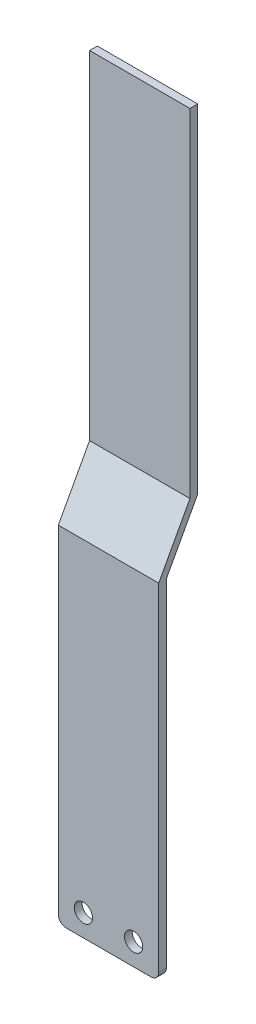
from build123d import *

# Parameters (mm, degrees)
SKETCH5_R           = 2.992510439
BOSS_EXTRUDE2_DEPTH = 2.54
BOSS_EXTRUDE3_DEPTH = 33.005669


with BuildPart() as part:
    # Sketch5 → Boss-Extrude2 (new body)
    with BuildSketch(Plane.XY):
        with BuildLine():
            Line((-16.129044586, 49.435557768), (-16.129044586, 151.804902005))
            Line((-16.129044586, 151.804902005), (16.876629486, 151.804902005))
            Line((16.876629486, 151.804902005), (16.876629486, 49.435557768))
            Line((16.876629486, 49.435557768), (16.876629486, 40.940152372))
            ThreePointArc((16.876629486, 40.940152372), (16.13268071, 39.144101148), (14.336629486, 38.400152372))
            Line((14.336629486, 38.400152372), (-13.589044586, 38.400152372))
            ThreePointArc((-13.589044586, 38.400152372), (-15.38509581, 39.144101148), (-16.129044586, 40.940152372))
            Line((-16.129044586, 40.940152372), (-16.129044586, 49.435557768))
        make_face()
        with Locations((-7.877626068, 45.58714903)):
            Circle(SKETCH5_R, mode=Mode.SUBTRACT)
        with Locations((8.625210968, 45.58714903)):
            Circle(SKETCH5_R, mode=Mode.SUBTRACT)
    extrude(amount=BOSS_EXTRUDE2_DEPTH)

    # Sketch7 → Boss-Extrude3 (add)
    with BuildSketch(Plane(origin=(16.876629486, 0, 0), x_dir=(0, 0, -1), z_dir=(1, 0, 0))):
        Polygon((-2.54, 151.804902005), (0, 151.804902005), (10.279242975, 170.743713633), (10.279242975, 281.828072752), (7.739242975, 281.828072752), (7.739242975, 170.743713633), align=None)
    extrude(amount=-BOSS_EXTRUDE3_DEPTH)


solid = part.part
